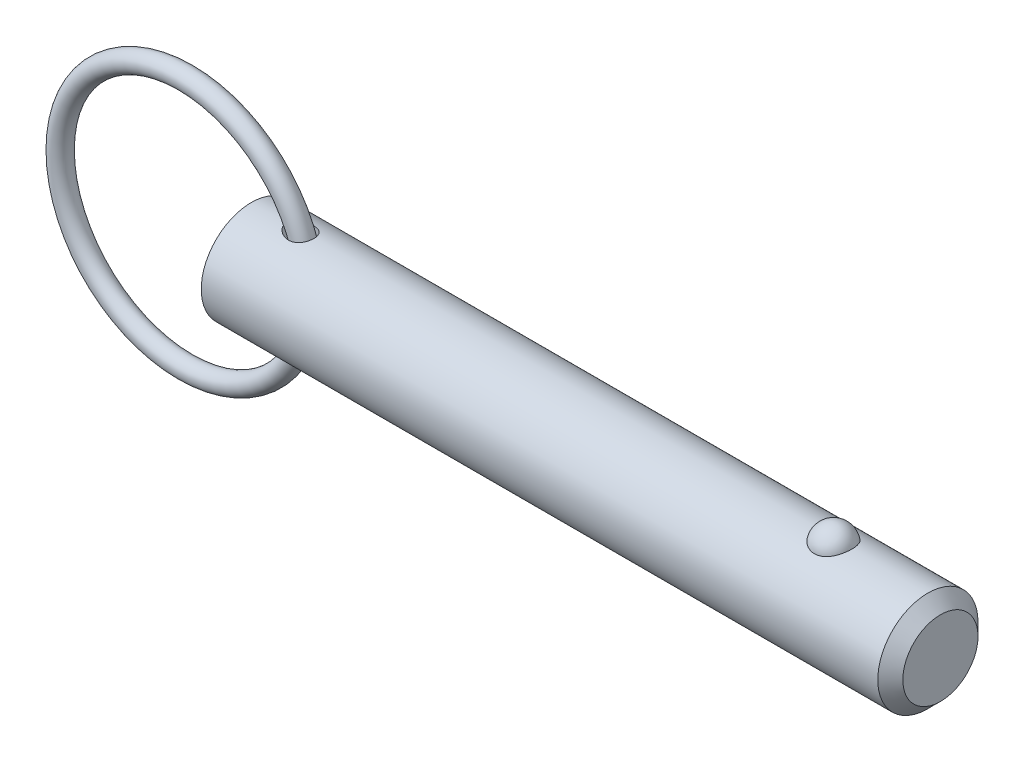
ISO-10303-21;
HEADER;
FILE_DESCRIPTION(('STEP AP214'),'2;1');
FILE_NAME('part.step','',(''),(''),'','','');
FILE_SCHEMA(('AUTOMOTIVE_DESIGN { 1 0 10303 214 1 1 1 1 }'));
ENDSEC;
DATA;
#1=APPLICATION_CONTEXT('core data for automotive mechanical design processes');
#2=APPLICATION_PROTOCOL_DEFINITION('international standard','automotive_design',2000,#1);
#3=PRODUCT_CONTEXT('',#1,'mechanical');
#4=PRODUCT('Part','Part','',(#3));
#5=PRODUCT_RELATED_PRODUCT_CATEGORY('part','',(#4));
#6=PRODUCT_DEFINITION_FORMATION('','',#4);
#7=PRODUCT_DEFINITION_CONTEXT('part definition',#1,'design');
#8=PRODUCT_DEFINITION('design','',#6,#7);
#9=PRODUCT_DEFINITION_SHAPE('','',#8);
#10=(LENGTH_UNIT() NAMED_UNIT(*) SI_UNIT(.MILLI.,.METRE.));
#11=(NAMED_UNIT(*) PLANE_ANGLE_UNIT() SI_UNIT($,.RADIAN.));
#12=(NAMED_UNIT(*) SI_UNIT($,.STERADIAN.) SOLID_ANGLE_UNIT());
#13=UNCERTAINTY_MEASURE_WITH_UNIT(LENGTH_MEASURE(1.E-05),#10,'distance_accuracy_value','');
#14=(GEOMETRIC_REPRESENTATION_CONTEXT(3) GLOBAL_UNCERTAINTY_ASSIGNED_CONTEXT((#13)) GLOBAL_UNIT_ASSIGNED_CONTEXT((#10,
#11,#12)) REPRESENTATION_CONTEXT('',''));
#15=CARTESIAN_POINT('',(0.,0.,0.));
#16=DIRECTION('',(0.,0.,1.));
#17=DIRECTION('',(1.,0.,0.));
#18=AXIS2_PLACEMENT_3D('',#15,#16,#17);
#19=CARTESIAN_POINT('',(-8.34703434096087,0.,0.));
#20=DIRECTION('',(0.,0.,1.));
#21=DIRECTION('',(1.,0.,0.));
#22=AXIS2_PLACEMENT_3D('',#19,#20,#21);
#23=TOROIDAL_SURFACE('',#22,15.875,1.27);
#24=CARTESIAN_POINT('',(8.79796565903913,0.,0.));
#25=VERTEX_POINT('',#24);
#26=VERTEX_LOOP('',#25);
#27=FACE_BOUND('',#26,.T.);
#28=ADVANCED_FACE('P0_F12',(#27),#23,.T.);
#29=CLOSED_SHELL('',(#28));
#30=MANIFOLD_SOLID_BREP('P0_B1',#29);
#31=CARTESIAN_POINT('',(0.,0.,0.));
#32=DIRECTION('',(1.,0.,0.));
#33=DIRECTION('',(0.,0.,-1.));
#34=AXIS2_PLACEMENT_3D('',#31,#32,#33);
#35=CYLINDRICAL_SURFACE('',#34,6.35);
#36=CARTESIAN_POINT('',(4.87230670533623,6.27273159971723,-0.987592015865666));
#37=CARTESIAN_POINT('',(4.94734735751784,6.26035058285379,-1.06623378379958));
#38=CARTESIAN_POINT('',(5.02968768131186,6.24755813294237,-1.13788608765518));
#39=CARTESIAN_POINT('',(5.2053426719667,6.22278258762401,-1.26640223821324));
#40=CARTESIAN_POINT('',(5.29867273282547,6.21080066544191,-1.32324497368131));
#41=CARTESIAN_POINT('',(5.49318962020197,6.18912414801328,-1.42117930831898));
#42=CARTESIAN_POINT('',(5.59435470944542,6.17942350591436,-1.46231273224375));
#43=CARTESIAN_POINT('',(5.80219659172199,6.16352555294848,-1.52793951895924));
#44=CARTESIAN_POINT('',(5.90887152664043,6.15732706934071,-1.55243845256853));
#45=CARTESIAN_POINT('',(6.12818220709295,6.14931784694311,-1.58387975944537));
#46=CARTESIAN_POINT('',(6.24090110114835,6.14763959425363,-1.59029227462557));
#47=CARTESIAN_POINT('',(6.46560233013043,6.14965588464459,-1.58248630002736));
#48=CARTESIAN_POINT('',(6.57758514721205,6.15334646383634,-1.56828303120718));
#49=CARTESIAN_POINT('',(6.78516594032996,6.1652116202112,-1.52091398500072));
#50=CARTESIAN_POINT('',(6.88126802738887,6.17288876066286,-1.48983713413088));
#51=CARTESIAN_POINT('',(7.06576629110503,6.19149190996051,-1.41052329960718));
#52=CARTESIAN_POINT('',(7.15416739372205,6.20241582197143,-1.36229738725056));
#53=CARTESIAN_POINT('',(7.31166929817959,6.2248616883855,-1.25548983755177));
#54=CARTESIAN_POINT('',(7.38181442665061,6.23621734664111,-1.19840625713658));
#55=CARTESIAN_POINT('',(7.51101296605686,6.259037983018,-1.07284763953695));
#56=CARTESIAN_POINT('',(7.57006844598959,6.2705029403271,-1.00437473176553));
#57=CARTESIAN_POINT('',(7.6737469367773,6.29184873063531,-0.860384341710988));
#58=CARTESIAN_POINT('',(7.71876694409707,6.30176816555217,-0.785157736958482));
#59=CARTESIAN_POINT('',(7.79574491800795,6.31935829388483,-0.628053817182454));
#60=CARTESIAN_POINT('',(7.82770308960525,6.32702902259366,-0.546176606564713));
#61=CARTESIAN_POINT('',(7.87788845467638,6.33930929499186,-0.377876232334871));
#62=CARTESIAN_POINT('',(7.89608106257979,6.34391112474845,-0.291442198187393));
#63=CARTESIAN_POINT('',(7.91820729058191,6.34953044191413,-0.116652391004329));
#64=CARTESIAN_POINT('',(7.9221404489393,6.35054781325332,-0.0282965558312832));
#65=CARTESIAN_POINT('',(7.91564686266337,6.34888556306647,0.148263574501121));
#66=CARTESIAN_POINT('',(7.90515337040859,6.34618875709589,0.236465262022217));
#67=CARTESIAN_POINT('',(7.8699153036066,6.33735741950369,0.409798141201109));
#68=CARTESIAN_POINT('',(7.84517062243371,6.33122286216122,0.494929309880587));
#69=CARTESIAN_POINT('',(7.7819985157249,6.31618517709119,0.659657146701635));
#70=CARTESIAN_POINT('',(7.74357645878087,6.30728313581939,0.739255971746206));
#71=CARTESIAN_POINT('',(7.65396632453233,6.28769050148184,0.890663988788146));
#72=CARTESIAN_POINT('',(7.60277911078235,6.27700002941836,0.962473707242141));
#73=CARTESIAN_POINT('',(7.48925881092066,6.2550822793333,1.09590260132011));
#74=CARTESIAN_POINT('',(7.42698604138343,6.24385813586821,1.15757361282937));
#75=CARTESIAN_POINT('',(7.29283556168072,6.2220655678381,1.26951234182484));
#76=CARTESIAN_POINT('',(7.2209588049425,6.21149707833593,1.31978118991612));
#77=CARTESIAN_POINT('',(7.06971853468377,6.19216002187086,1.40772509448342));
#78=CARTESIAN_POINT('',(6.99035873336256,6.18339056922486,1.44540635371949));
#79=CARTESIAN_POINT('',(6.82642723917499,6.16851603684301,1.50762653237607));
#80=CARTESIAN_POINT('',(6.7418548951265,6.16241129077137,1.53216380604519));
#81=CARTESIAN_POINT('',(6.56686412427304,6.15321474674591,1.56869994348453));
#82=CARTESIAN_POINT('',(6.47634467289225,6.15023369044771,1.58023897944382));
#83=CARTESIAN_POINT('',(6.29456956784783,6.14778331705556,1.58974172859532));
#84=CARTESIAN_POINT('',(6.20331368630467,6.1483151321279,1.58770106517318));
#85=CARTESIAN_POINT('',(6.01385969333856,6.15284811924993,1.5700487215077));
#86=CARTESIAN_POINT('',(5.91578322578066,6.15715979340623,1.55322212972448));
#87=CARTESIAN_POINT('',(5.72331909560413,6.16902415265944,1.5054032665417));
#88=CARTESIAN_POINT('',(5.6289344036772,6.17657939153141,1.4743998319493));
#89=CARTESIAN_POINT('',(5.4357260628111,6.19502494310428,1.39499475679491));
#90=CARTESIAN_POINT('',(5.33755891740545,6.20619097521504,1.34505268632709));
#91=CARTESIAN_POINT('',(5.15090047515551,6.23006191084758,1.22975103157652));
#92=CARTESIAN_POINT('',(5.06240741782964,6.24276653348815,1.16439425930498));
#93=CARTESIAN_POINT('',(4.91171642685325,6.26607433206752,1.03083814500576));
#94=CARTESIAN_POINT('',(4.84758224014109,6.27668356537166,0.964825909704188));
#95=CARTESIAN_POINT('',(4.73090054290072,6.29683133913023,0.823112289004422));
#96=CARTESIAN_POINT('',(4.67833688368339,6.30637136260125,0.747424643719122));
#97=CARTESIAN_POINT('',(4.59543145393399,6.32183254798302,0.601150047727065));
#98=CARTESIAN_POINT('',(4.56283099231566,6.32809321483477,0.531883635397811));
#99=CARTESIAN_POINT('',(4.50941370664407,6.33849198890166,0.388778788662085));
#100=CARTESIAN_POINT('',(4.48858876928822,6.34263155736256,0.314943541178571));
#101=CARTESIAN_POINT('',(4.46008864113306,6.3483236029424,0.164282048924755));
#102=CARTESIAN_POINT('',(4.45247558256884,6.34986385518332,0.08744340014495));
#103=CARTESIAN_POINT('',(4.45121096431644,6.35011863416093,-0.0663538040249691));
#104=CARTESIAN_POINT('',(4.45755802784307,6.34883343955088,-0.143312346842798));
#105=CARTESIAN_POINT('',(4.48267656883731,6.34380948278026,-0.288945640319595));
#106=CARTESIAN_POINT('',(4.50045680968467,6.34026665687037,-0.357802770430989));
#107=CARTESIAN_POINT('',(4.54636050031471,6.33128211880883,-0.491815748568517));
#108=CARTESIAN_POINT('',(4.57448566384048,6.32584009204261,-0.556970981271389));
#109=CARTESIAN_POINT('',(4.64209700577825,6.31308107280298,-0.687092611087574));
#110=CARTESIAN_POINT('',(4.68226903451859,6.30565525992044,-0.751689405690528));
#111=CARTESIAN_POINT('',(4.77120834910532,6.28979741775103,-0.874524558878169));
#112=CARTESIAN_POINT('',(4.81998302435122,6.28136452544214,-0.932757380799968));
#113=CARTESIAN_POINT('',(4.87230670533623,6.27273159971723,-0.987592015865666));
#114=B_SPLINE_CURVE_WITH_KNOTS('',3,(#36,#37,#38,#39,#40,#41,#42,#43,#44,#45,#46,#47,#48,#49,
#50,#51,#52,#53,#54,#55,#56,#57,#58,#59,#60,#61,#62,#63,#64,#65,#66,#67,#68,#69,#70,#71,#72,#73,
#74,#75,#76,#77,#78,#79,#80,#81,#82,#83,#84,#85,#86,#87,#88,#89,#90,#91,#92,#93,#94,#95,#96,#97,
#98,#99,#100,#101,#102,#103,#104,#105,#106,#107,#108,#109,#110,#111,#112,#113),.UNSPECIFIED.,
.T.,.F.,(4,2,2,2,2,2,2,2,2,2,2,2,2,2,2,2,2,2,2,2,2,2,2,2,2,2,2,2,2,2,2,2,2,2,2,2,2,2,4),(0.,
0.327902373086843,0.65626964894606,0.983756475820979,1.31113357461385,1.64800657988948,
1.98463099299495,2.28681225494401,2.58879878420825,2.86088594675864,3.13292229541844,
3.3963648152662,3.65980320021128,3.92390128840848,4.18800792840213,4.45334062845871,
4.7186753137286,4.98390596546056,5.24911867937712,5.51293017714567,5.7767155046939,
6.04037065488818,6.30405880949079,6.57680801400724,6.84964512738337,7.14724526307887,
7.44508014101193,7.77572668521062,8.10631295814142,8.38318772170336,8.65967357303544,
8.88915303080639,9.11847418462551,9.34887088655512,9.57924486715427,9.79193291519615,
10.0046562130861,10.2330958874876,10.4617327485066),.UNSPECIFIED.);
#115=CARTESIAN_POINT('',(4.87230670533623,6.27273159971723,-0.987592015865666));
#116=VERTEX_POINT('',#115);
#117=EDGE_CURVE('P1_E40',#116,#116,#114,.T.);
#118=ORIENTED_EDGE('',*,*,#117,.T.);
#119=EDGE_LOOP('',(#118));
#120=FACE_BOUND('',#119,.T.);
#121=CARTESIAN_POINT('',(85.7125,0.,0.));
#122=DIRECTION('',(1.,0.,0.));
#123=DIRECTION('',(0.,0.,-1.));
#124=AXIS2_PLACEMENT_3D('',#121,#122,#123);
#125=CIRCLE('',#124,6.35);
#126=CARTESIAN_POINT('',(85.7125,0.,-6.35));
#127=VERTEX_POINT('',#126);
#128=EDGE_CURVE('P1_E25',#127,#127,#125,.T.);
#129=ORIENTED_EDGE('',*,*,#128,.F.);
#130=EDGE_LOOP('',(#129));
#131=FACE_BOUND('',#130,.T.);
#132=CARTESIAN_POINT('',(0.,0.,0.));
#133=DIRECTION('',(1.,0.,0.));
#134=DIRECTION('',(0.,0.,-1.));
#135=AXIS2_PLACEMENT_3D('',#132,#133,#134);
#136=CIRCLE('',#135,6.35);
#137=CARTESIAN_POINT('',(0.,0.,-6.35));
#138=VERTEX_POINT('',#137);
#139=EDGE_CURVE('P1_E9',#138,#138,#136,.T.);
#140=ORIENTED_EDGE('',*,*,#139,.T.);
#141=EDGE_LOOP('',(#140));
#142=FACE_BOUND('',#141,.T.);
#143=CARTESIAN_POINT('',(73.7500214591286,5.87502187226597,2.40969251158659));
#144=CARTESIAN_POINT('',(73.6250305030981,5.87501645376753,2.40969773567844));
#145=CARTESIAN_POINT('',(73.5000806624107,5.87916061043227,2.39967292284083));
#146=CARTESIAN_POINT('',(73.2539091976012,5.8952311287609,2.3599173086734));
#147=CARTESIAN_POINT('',(73.1326863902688,5.90715499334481,2.33019283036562));
#148=CARTESIAN_POINT('',(72.8975170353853,5.93739567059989,2.25201402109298));
#149=CARTESIAN_POINT('',(72.7835602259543,5.95570321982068,2.2035868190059));
#150=CARTESIAN_POINT('',(72.5655735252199,5.99672067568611,2.08937987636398));
#151=CARTESIAN_POINT('',(72.4615457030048,6.01943149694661,2.02359652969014));
#152=CARTESIAN_POINT('',(72.2629437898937,6.06760647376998,1.87428969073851));
#153=CARTESIAN_POINT('',(72.1687268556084,6.09313095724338,1.79031110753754));
#154=CARTESIAN_POINT('',(71.9952557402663,6.14375873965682,1.60800178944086));
#155=CARTESIAN_POINT('',(71.9160043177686,6.16886196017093,1.50966841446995));
#156=CARTESIAN_POINT('',(71.7708457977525,6.21724600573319,1.29645884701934));
#157=CARTESIAN_POINT('',(71.7056885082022,6.24039621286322,1.18104158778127));
#158=CARTESIAN_POINT('',(71.5947035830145,6.28117277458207,0.94035184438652));
#159=CARTESIAN_POINT('',(71.5488776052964,6.29879865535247,0.81507851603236));
#160=CARTESIAN_POINT('',(71.4770234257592,6.32692073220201,0.556494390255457));
#161=CARTESIAN_POINT('',(71.451249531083,6.33732517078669,0.423102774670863));
#162=CARTESIAN_POINT('',(71.4209885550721,6.34957673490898,0.153542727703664));
#163=CARTESIAN_POINT('',(71.4165009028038,6.35142408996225,0.0173743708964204));
#164=CARTESIAN_POINT('',(71.4288655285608,6.34638925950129,-0.253036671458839));
#165=CARTESIAN_POINT('',(71.4455949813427,6.33955731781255,-0.387285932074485));
#166=CARTESIAN_POINT('',(71.499843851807,6.31794129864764,-0.650851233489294));
#167=CARTESIAN_POINT('',(71.5373636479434,6.30315707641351,-0.780167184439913));
#168=CARTESIAN_POINT('',(71.632500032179,6.26711642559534,-1.03041949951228));
#169=CARTESIAN_POINT('',(71.690143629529,6.24585130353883,-1.15134433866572));
#170=CARTESIAN_POINT('',(71.8243522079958,6.19905619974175,-1.38129800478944));
#171=CARTESIAN_POINT('',(71.9009187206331,6.17352587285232,-1.49032586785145));
#172=CARTESIAN_POINT('',(72.0717538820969,6.12080227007,-1.69393164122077));
#173=CARTESIAN_POINT('',(72.1661008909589,6.09360200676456,-1.78844209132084));
#174=CARTESIAN_POINT('',(72.3701196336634,6.04070434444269,-1.95970536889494));
#175=CARTESIAN_POINT('',(72.4797900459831,6.01500681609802,-2.03645972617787));
#176=CARTESIAN_POINT('',(72.7091876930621,5.96867714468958,-2.1684564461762));
#177=CARTESIAN_POINT('',(72.8286522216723,5.94794910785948,-2.2241206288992));
#178=CARTESIAN_POINT('',(73.0762188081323,5.91340580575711,-2.31440992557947));
#179=CARTESIAN_POINT('',(73.2043175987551,5.89958794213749,-2.3490429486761));
#180=CARTESIAN_POINT('',(73.458582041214,5.88111049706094,-2.39491590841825));
#181=CARTESIAN_POINT('',(73.5845207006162,5.876025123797,-2.40724512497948));
#182=CARTESIAN_POINT('',(73.8367867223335,5.87428980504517,-2.41147867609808));
#183=CARTESIAN_POINT('',(73.963114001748,5.87763817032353,-2.40338710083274));
#184=CARTESIAN_POINT('',(74.2084170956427,5.89212921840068,-2.36762715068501));
#185=CARTESIAN_POINT('',(74.3274992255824,5.90302431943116,-2.34058030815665));
#186=CARTESIAN_POINT('',(74.5592447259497,5.93113752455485,-2.26839066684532));
#187=CARTESIAN_POINT('',(74.6719075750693,5.94835614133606,-2.22324640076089));
#188=CARTESIAN_POINT('',(74.8904009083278,5.98773016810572,-2.11493806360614));
#189=CARTESIAN_POINT('',(74.996028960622,6.00998499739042,-2.05140269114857));
#190=CARTESIAN_POINT('',(75.1953006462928,6.05690144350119,-1.90842705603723));
#191=CARTESIAN_POINT('',(75.2889415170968,6.08156361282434,-1.8289831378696));
#192=CARTESIAN_POINT('',(75.4666754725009,6.13211715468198,-1.65182429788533));
#193=CARTESIAN_POINT('',(75.5500559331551,6.15800825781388,-1.55339381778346));
#194=CARTESIAN_POINT('',(75.6997900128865,6.20712834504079,-1.34374214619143));
#195=CARTESIAN_POINT('',(75.7661405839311,6.23035685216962,-1.23251867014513));
#196=CARTESIAN_POINT('',(75.8823455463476,6.27251177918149,-0.996447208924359));
#197=CARTESIAN_POINT('',(75.9316072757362,6.29127762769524,-0.871278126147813));
#198=CARTESIAN_POINT('',(76.0096142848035,6.3215862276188,-0.613870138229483));
#199=CARTESIAN_POINT('',(76.038359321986,6.33312889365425,-0.481631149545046));
#200=CARTESIAN_POINT('',(76.0747705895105,6.34782349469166,-0.213672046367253));
#201=CARTESIAN_POINT('',(76.0824134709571,6.35096613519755,-0.0779482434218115));
#202=CARTESIAN_POINT('',(76.0763951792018,6.34851322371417,0.192943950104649));
#203=CARTESIAN_POINT('',(76.0627343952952,6.3429178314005,0.328112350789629));
#204=CARTESIAN_POINT('',(76.0145036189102,6.32360512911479,0.593406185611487));
#205=CARTESIAN_POINT('',(75.9800313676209,6.30992579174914,0.723552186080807));
#206=CARTESIAN_POINT('',(75.8909539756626,6.27586325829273,0.975834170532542));
#207=CARTESIAN_POINT('',(75.8363476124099,6.25547965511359,1.09796966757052));
#208=CARTESIAN_POINT('',(75.7077587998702,6.20998183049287,1.33148921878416));
#209=CARTESIAN_POINT('',(75.6336742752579,6.18484288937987,1.44281227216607));
#210=CARTESIAN_POINT('',(75.4678204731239,6.13258735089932,1.65087683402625));
#211=CARTESIAN_POINT('',(75.3760515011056,6.10547078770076,1.74761859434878));
#212=CARTESIAN_POINT('',(75.1771839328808,6.0523587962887,1.92350926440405));
#213=CARTESIAN_POINT('',(75.070133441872,6.0263601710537,2.00271146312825));
#214=CARTESIAN_POINT('',(74.8431384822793,5.97843747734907,2.14154159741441));
#215=CARTESIAN_POINT('',(74.723191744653,5.95651412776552,2.20116608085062));
#216=CARTESIAN_POINT('',(74.4645236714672,5.91812106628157,2.30250570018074));
#217=CARTESIAN_POINT('',(74.3250698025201,5.90217533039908,2.34256795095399));
#218=CARTESIAN_POINT('',(74.0403974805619,5.88063128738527,2.39615214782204));
#219=CARTESIAN_POINT('',(73.8951817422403,5.8750281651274,2.40968644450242));
#220=CARTESIAN_POINT('',(73.7500214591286,5.87502187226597,2.40969251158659));
#221=B_SPLINE_CURVE_WITH_KNOTS('',3,(#143,#144,#145,#146,#147,#148,#149,#150,#151,#152,#153,
#154,#155,#156,#157,#158,#159,#160,#161,#162,#163,#164,#165,#166,#167,#168,#169,#170,#171,#172,
#173,#174,#175,#176,#177,#178,#179,#180,#181,#182,#183,#184,#185,#186,#187,#188,#189,#190,#191,
#192,#193,#194,#195,#196,#197,#198,#199,#200,#201,#202,#203,#204,#205,#206,#207,#208,#209,#210,
#211,#212,#213,#214,#215,#216,#217,#218,#219,#220),.UNSPECIFIED.,.T.,.F.,(4,2,2,2,2,2,2,2,2,2,2,
2,2,2,2,2,2,2,2,2,2,2,2,2,2,2,2,2,2,2,2,2,2,2,2,2,2,2,4),(0.,0.374440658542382,
0.748761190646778,1.12254078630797,1.49639810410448,1.88098871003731,2.26565013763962,
2.66741104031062,3.06920639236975,3.47601794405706,3.88281858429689,4.28727498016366,
4.69173873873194,5.09674745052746,5.50178895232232,5.90865911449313,6.31549420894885,
6.71369855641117,7.11175305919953,7.48978077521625,7.86773278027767,8.23383886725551,
8.59997464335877,8.97409044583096,9.34829231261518,9.74122667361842,10.1342313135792,
10.5397522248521,10.9452779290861,11.3512521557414,11.7572189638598,12.1612938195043,
12.5653932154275,12.9716540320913,13.3779078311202,13.7829098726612,14.1879832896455,
14.6230486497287,15.0579114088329),.UNSPECIFIED.);
#222=CARTESIAN_POINT('',(73.7500214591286,5.87502187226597,2.40969251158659));
#223=VERTEX_POINT('',#222);
#224=EDGE_CURVE('P1_E34',#223,#223,#221,.T.);
#225=ORIENTED_EDGE('',*,*,#224,.T.);
#226=EDGE_LOOP('',(#225));
#227=FACE_BOUND('',#226,.T.);
#228=CARTESIAN_POINT('',(4.87230670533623,-6.27273159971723,-0.987592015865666));
#229=CARTESIAN_POINT('',(4.81440819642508,-6.28228431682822,-0.926913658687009));
#230=CARTESIAN_POINT('',(4.76085022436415,-6.29159289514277,-0.862071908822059));
#231=CARTESIAN_POINT('',(4.66448472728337,-6.3088950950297,-0.72465504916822));
#232=CARTESIAN_POINT('',(4.62166818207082,-6.31688981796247,-0.652086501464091));
#233=CARTESIAN_POINT('',(4.54882773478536,-6.33076917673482,-0.49974775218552));
#234=CARTESIAN_POINT('',(4.51891553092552,-6.33663532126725,-0.419921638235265));
#235=CARTESIAN_POINT('',(4.47476924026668,-6.3453711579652,-0.255882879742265));
#236=CARTESIAN_POINT('',(4.46051880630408,-6.34824397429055,-0.171674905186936));
#237=CARTESIAN_POINT('',(4.44966179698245,-6.35043041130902,-0.0120763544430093));
#238=CARTESIAN_POINT('',(4.45117530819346,-6.35012328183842,0.0631849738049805));
#239=CARTESIAN_POINT('',(4.46726452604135,-6.34689000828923,0.212230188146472));
#240=CARTESIAN_POINT('',(4.48184026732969,-6.3439638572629,0.286014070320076));
#241=CARTESIAN_POINT('',(4.52202068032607,-6.33603071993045,0.426550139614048));
#242=CARTESIAN_POINT('',(4.54707079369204,-6.33112875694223,0.493469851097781));
#243=CARTESIAN_POINT('',(4.6066985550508,-6.31972370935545,0.622743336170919));
#244=CARTESIAN_POINT('',(4.64127887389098,-6.31322017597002,0.685095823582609));
#245=CARTESIAN_POINT('',(4.72328142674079,-6.29826068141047,0.811769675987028));
#246=CARTESIAN_POINT('',(4.77176118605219,-6.28966287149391,0.875386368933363));
#247=CARTESIAN_POINT('',(4.87703902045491,-6.27182325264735,0.99519278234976));
#248=CARTESIAN_POINT('',(4.93384225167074,-6.26258104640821,1.05137785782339));
#249=CARTESIAN_POINT('',(5.06617436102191,-6.24228878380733,1.16635591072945));
#250=CARTESIAN_POINT('',(5.14318167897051,-6.23124423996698,1.22345054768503));
#251=CARTESIAN_POINT('',(5.30475767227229,-6.21023402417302,1.32598441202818));
#252=CARTESIAN_POINT('',(5.38933237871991,-6.20026922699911,1.37141422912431));
#253=CARTESIAN_POINT('',(5.5776013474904,-6.18099350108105,1.45601817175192));
#254=CARTESIAN_POINT('',(5.68224348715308,-6.17201456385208,1.4931788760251));
#255=CARTESIAN_POINT('',(5.89649087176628,-6.15800474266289,1.5499484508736));
#256=CARTESIAN_POINT('',(6.0060970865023,-6.15297463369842,1.56955387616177));
#257=CARTESIAN_POINT('',(6.22752772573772,-6.14779725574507,1.58971993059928));
#258=CARTESIAN_POINT('',(6.33935715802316,-6.14766266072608,1.59023112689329));
#259=CARTESIAN_POINT('',(6.56108231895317,-6.15269227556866,1.57066564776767));
#260=CARTESIAN_POINT('',(6.67097982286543,-6.15785133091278,1.55060899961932));
#261=CARTESIAN_POINT('',(6.87257705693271,-6.17211580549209,1.4927326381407));
#262=CARTESIAN_POINT('',(6.96494608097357,-6.18072242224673,1.45711948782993));
#263=CARTESIAN_POINT('',(7.14129343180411,-6.20069920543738,1.36960980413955));
#264=CARTESIAN_POINT('',(7.22527609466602,-6.21206793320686,1.31772174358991));
#265=CARTESIAN_POINT('',(7.37471505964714,-6.23497047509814,1.20443359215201));
#266=CARTESIAN_POINT('',(7.44115811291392,-6.24639757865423,1.14430788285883));
#267=CARTESIAN_POINT('',(7.56261868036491,-6.26896339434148,1.0134084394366));
#268=CARTESIAN_POINT('',(7.61763801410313,-6.28010215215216,0.942636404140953));
#269=CARTESIAN_POINT('',(7.71360563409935,-6.30055923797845,0.794304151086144));
#270=CARTESIAN_POINT('',(7.75485562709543,-6.3099143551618,0.716943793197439));
#271=CARTESIAN_POINT('',(7.82406051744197,-6.32610528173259,0.556244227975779));
#272=CARTESIAN_POINT('',(7.85201540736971,-6.33294108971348,0.472905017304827));
#273=CARTESIAN_POINT('',(7.89408663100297,-6.34338077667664,0.302249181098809));
#274=CARTESIAN_POINT('',(7.90814615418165,-6.34697138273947,0.214917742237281));
#275=CARTESIAN_POINT('',(7.92192329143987,-6.35048887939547,0.0390564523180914));
#276=CARTESIAN_POINT('',(7.92164046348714,-6.3504156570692,-0.0494734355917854));
#277=CARTESIAN_POINT('',(7.90670754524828,-6.34660520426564,-0.225592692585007));
#278=CARTESIAN_POINT('',(7.89199989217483,-6.34285329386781,-0.31317687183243));
#279=CARTESIAN_POINT('',(7.8484534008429,-6.33206809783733,-0.484549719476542));
#280=CARTESIAN_POINT('',(7.81961455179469,-6.32503480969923,-0.568338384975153));
#281=CARTESIAN_POINT('',(7.74850591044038,-6.30846389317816,-0.729625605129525));
#282=CARTESIAN_POINT('',(7.70625193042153,-6.29892921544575,-0.807131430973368));
#283=CARTESIAN_POINT('',(7.60933437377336,-6.27840608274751,-0.953731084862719));
#284=CARTESIAN_POINT('',(7.55467181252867,-6.2674177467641,-1.02282560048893));
#285=CARTESIAN_POINT('',(7.43471786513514,-6.24527869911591,-1.15028913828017));
#286=CARTESIAN_POINT('',(7.36948829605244,-6.23412925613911,-1.20871657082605));
#287=CARTESIAN_POINT('',(7.2300172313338,-6.21283678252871,-1.3137894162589));
#288=CARTESIAN_POINT('',(7.15577649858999,-6.20269366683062,-1.36043582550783));
#289=CARTESIAN_POINT('',(7.00025986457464,-6.18446636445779,-1.4410399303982));
#290=CARTESIAN_POINT('',(6.91896776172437,-6.17638709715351,-1.47496739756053));
#291=CARTESIAN_POINT('',(6.75184232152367,-6.16309237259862,-1.52957024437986));
#292=CARTESIAN_POINT('',(6.66600814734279,-6.15787744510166,-1.55024317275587));
#293=CARTESIAN_POINT('',(6.48842585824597,-6.15055064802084,-1.57906962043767));
#294=CARTESIAN_POINT('',(6.39658108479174,-6.14857915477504,-1.58665744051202));
#295=CARTESIAN_POINT('',(6.21279832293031,-6.14817707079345,-1.58821048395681));
#296=CARTESIAN_POINT('',(6.12086031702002,-6.14974736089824,-1.58217231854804));
#297=CARTESIAN_POINT('',(5.92996902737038,-6.15640095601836,-1.55609403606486));
#298=CARTESIAN_POINT('',(5.83120653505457,-6.16181208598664,-1.53474519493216));
#299=CARTESIAN_POINT('',(5.63804881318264,-6.17573474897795,-1.47771859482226));
#300=CARTESIAN_POINT('',(5.54365953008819,-6.18425037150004,-1.44202192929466));
#301=CARTESIAN_POINT('',(5.34413923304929,-6.20522938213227,-1.34918979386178));
#302=CARTESIAN_POINT('',(5.24033140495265,-6.21813417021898,-1.28928337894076));
#303=CARTESIAN_POINT('',(5.04554233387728,-6.24510162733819,-1.15156760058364));
#304=CARTESIAN_POINT('',(4.9545459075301,-6.25916289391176,-1.07377972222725));
#305=CARTESIAN_POINT('',(4.87230670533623,-6.27273159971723,-0.987592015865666));
#306=B_SPLINE_CURVE_WITH_KNOTS('',3,(#228,#229,#230,#231,#232,#233,#234,#235,#236,#237,#238,
#239,#240,#241,#242,#243,#244,#245,#246,#247,#248,#249,#250,#251,#252,#253,#254,#255,#256,#257,
#258,#259,#260,#261,#262,#263,#264,#265,#266,#267,#268,#269,#270,#271,#272,#273,#274,#275,#276,
#277,#278,#279,#280,#281,#282,#283,#284,#285,#286,#287,#288,#289,#290,#291,#292,#293,#294,#295,
#296,#297,#298,#299,#300,#301,#302,#303,#304,#305),.UNSPECIFIED.,.T.,.F.,(4,2,2,2,2,2,2,2,2,2,2,
2,2,2,2,2,2,2,2,2,2,2,2,2,2,2,2,2,2,2,2,2,2,2,2,2,2,2,4),(0.,0.252951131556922,
0.505689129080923,0.760572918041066,1.01519041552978,1.23982791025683,1.46446600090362,
1.67847364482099,1.89254132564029,2.13299551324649,2.37359928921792,2.6619896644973,
2.95061196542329,3.28329078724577,3.61603488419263,3.9496403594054,4.28292130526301,
4.57939201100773,4.87570862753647,5.14538810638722,5.41502459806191,5.67829123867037,
5.94155802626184,6.20589676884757,6.47024365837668,6.73564974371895,7.00105603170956,
7.26615064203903,7.53122356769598,7.79479837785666,8.05835088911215,8.32252586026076,
8.58674967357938,8.86213419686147,9.137587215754,9.43991696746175,9.74264642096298,
10.1023688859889,10.461661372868),.UNSPECIFIED.);
#307=CARTESIAN_POINT('',(4.87230670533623,-6.27273159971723,-0.987592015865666));
#308=VERTEX_POINT('',#307);
#309=EDGE_CURVE('P1_E17',#308,#308,#306,.T.);
#310=ORIENTED_EDGE('',*,*,#309,.T.);
#311=EDGE_LOOP('',(#310));
#312=FACE_BOUND('',#311,.T.);
#313=ADVANCED_FACE('P1_F13',(#120,#131,#142,#227,#312),#35,.T.);
#314=CARTESIAN_POINT('',(0.,0.,0.));
#315=DIRECTION('',(-1.,0.,0.));
#316=DIRECTION('',(0.,0.,1.));
#317=AXIS2_PLACEMENT_3D('',#314,#315,#316);
#318=PLANE('',#317);
#319=ORIENTED_EDGE('',*,*,#139,.F.);
#320=EDGE_LOOP('',(#319));
#321=FACE_BOUND('',#320,.T.);
#322=ADVANCED_FACE('P1_F15',(#321),#318,.T.);
#323=CARTESIAN_POINT('',(87.3,0.,0.));
#324=DIRECTION('',(-1.,0.,0.));
#325=DIRECTION('',(0.,0.,1.));
#326=AXIS2_PLACEMENT_3D('',#323,#324,#325);
#327=CONICAL_SURFACE('',#326,4.76250000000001,0.785398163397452);
#328=ORIENTED_EDGE('',*,*,#128,.T.);
#329=EDGE_LOOP('',(#328));
#330=FACE_BOUND('',#329,.T.);
#331=CARTESIAN_POINT('',(87.3,0.,0.));
#332=DIRECTION('',(1.,0.,0.));
#333=DIRECTION('',(0.,0.,-1.));
#334=AXIS2_PLACEMENT_3D('',#331,#332,#333);
#335=CIRCLE('',#334,4.76250000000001);
#336=CARTESIAN_POINT('',(87.3,0.,-4.76250000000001));
#337=VERTEX_POINT('',#336);
#338=EDGE_CURVE('P1_E30',#337,#337,#335,.T.);
#339=ORIENTED_EDGE('',*,*,#338,.F.);
#340=EDGE_LOOP('',(#339));
#341=FACE_BOUND('',#340,.T.);
#342=ADVANCED_FACE('P1_F55',(#330,#341),#327,.T.);
#343=CARTESIAN_POINT('',(87.3,4.76250000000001,0.));
#344=DIRECTION('',(1.,0.,0.));
#345=DIRECTION('',(0.,0.,-1.));
#346=AXIS2_PLACEMENT_3D('',#343,#344,#345);
#347=PLANE('',#346);
#348=ORIENTED_EDGE('',*,*,#338,.T.);
#349=EDGE_LOOP('',(#348));
#350=FACE_BOUND('',#349,.T.);
#351=ADVANCED_FACE('P1_F51',(#350),#347,.T.);
#352=CARTESIAN_POINT('',(73.7500214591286,5.715,0.));
#353=DIRECTION('',(-1.,0.,0.));
#354=DIRECTION('',(0.,1.,0.));
#355=AXIS2_PLACEMENT_3D('',#352,#353,#354);
#356=SPHERICAL_SURFACE('',#355,2.415);
#357=ORIENTED_EDGE('',*,*,#224,.F.);
#358=EDGE_LOOP('',(#357));
#359=FACE_BOUND('',#358,.T.);
#360=ADVANCED_FACE('P1_F46',(#359),#356,.T.);
#361=CARTESIAN_POINT('',(-8.34703434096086,0.,0.));
#362=DIRECTION('',(0.,0.,1.));
#363=DIRECTION('',(1.,0.,0.));
#364=AXIS2_PLACEMENT_3D('',#361,#362,#363);
#365=TOROIDAL_SURFACE('',#364,15.875,1.5875);
#366=ORIENTED_EDGE('',*,*,#309,.F.);
#367=EDGE_LOOP('',(#366));
#368=FACE_BOUND('',#367,.T.);
#369=ORIENTED_EDGE('',*,*,#117,.F.);
#370=EDGE_LOOP('',(#369));
#371=FACE_BOUND('',#370,.T.);
#372=ADVANCED_FACE('P1_F50',(#368,#371),#365,.F.);
#373=CLOSED_SHELL('',(#313,#322,#342,#351,#360,#372));
#374=MANIFOLD_SOLID_BREP('P1_B1',#373);
#375=ADVANCED_BREP_SHAPE_REPRESENTATION('',(#18,#30,#374),#14);
#376=SHAPE_DEFINITION_REPRESENTATION(#9,#375);
ENDSEC;
END-ISO-10303-21;
